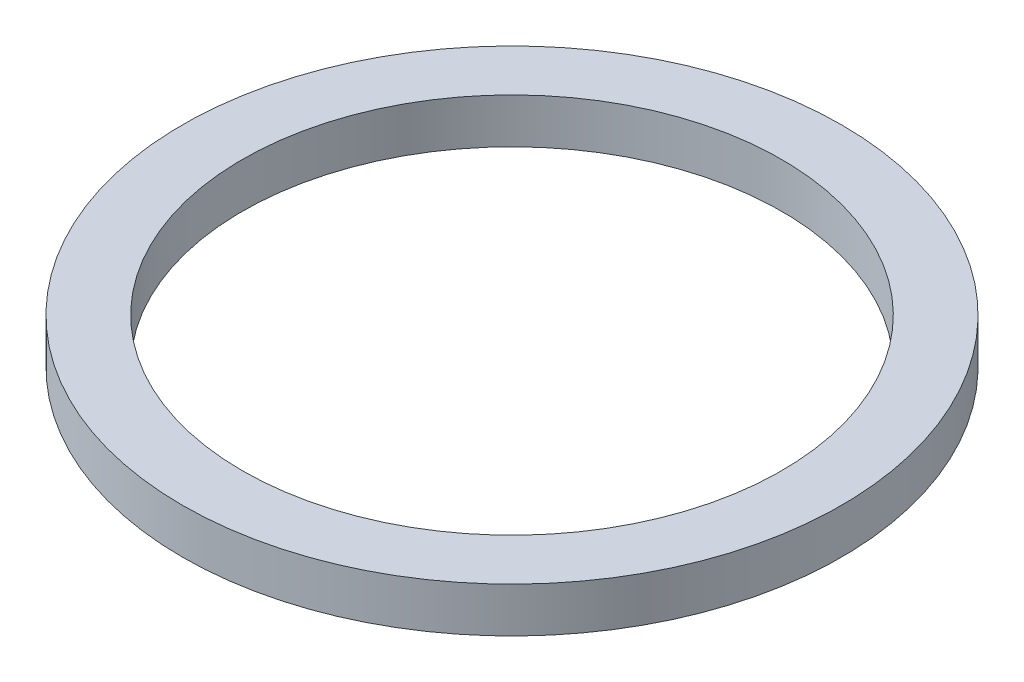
ISO-10303-21;
HEADER;
FILE_DESCRIPTION(('STEP AP214'),'2;1');
FILE_NAME('part.step','',(''),(''),'','','');
FILE_SCHEMA(('AUTOMOTIVE_DESIGN { 1 0 10303 214 1 1 1 1 }'));
ENDSEC;
DATA;
#1=APPLICATION_CONTEXT('core data for automotive mechanical design processes');
#2=APPLICATION_PROTOCOL_DEFINITION('international standard','automotive_design',2000,#1);
#3=PRODUCT_CONTEXT('',#1,'mechanical');
#4=PRODUCT('Part','Part','',(#3));
#5=PRODUCT_RELATED_PRODUCT_CATEGORY('part','',(#4));
#6=PRODUCT_DEFINITION_FORMATION('','',#4);
#7=PRODUCT_DEFINITION_CONTEXT('part definition',#1,'design');
#8=PRODUCT_DEFINITION('design','',#6,#7);
#9=PRODUCT_DEFINITION_SHAPE('','',#8);
#10=(LENGTH_UNIT() NAMED_UNIT(*) SI_UNIT(.MILLI.,.METRE.));
#11=(NAMED_UNIT(*) PLANE_ANGLE_UNIT() SI_UNIT($,.RADIAN.));
#12=(NAMED_UNIT(*) SI_UNIT($,.STERADIAN.) SOLID_ANGLE_UNIT());
#13=UNCERTAINTY_MEASURE_WITH_UNIT(LENGTH_MEASURE(1.E-05),#10,'distance_accuracy_value','');
#14=(GEOMETRIC_REPRESENTATION_CONTEXT(3) GLOBAL_UNCERTAINTY_ASSIGNED_CONTEXT((#13)) GLOBAL_UNIT_ASSIGNED_CONTEXT((#10,
#11,#12)) REPRESENTATION_CONTEXT('',''));
#15=CARTESIAN_POINT('',(0.,0.,0.));
#16=DIRECTION('',(0.,0.,1.));
#17=DIRECTION('',(1.,0.,0.));
#18=AXIS2_PLACEMENT_3D('',#15,#16,#17);
#19=CARTESIAN_POINT('',(0.,1500.,0.));
#20=DIRECTION('',(0.,1.,0.));
#21=DIRECTION('',(0.,0.,1.));
#22=AXIS2_PLACEMENT_3D('',#19,#20,#21);
#23=PLANE('',#22);
#24=CARTESIAN_POINT('',(0.,1500.,0.));
#25=DIRECTION('',(0.,1.,0.));
#26=DIRECTION('',(0.,0.,1.));
#27=AXIS2_PLACEMENT_3D('',#24,#25,#26);
#28=CIRCLE('',#27,11000.);
#29=CARTESIAN_POINT('',(0.,1500.,11000.));
#30=VERTEX_POINT('',#29);
#31=EDGE_CURVE('E10',#30,#30,#28,.T.);
#32=ORIENTED_EDGE('',*,*,#31,.T.);
#33=EDGE_LOOP('',(#32));
#34=FACE_BOUND('',#33,.T.);
#35=CARTESIAN_POINT('',(0.,1500.,0.));
#36=DIRECTION('',(0.,1.,0.));
#37=DIRECTION('',(0.,0.,1.));
#38=AXIS2_PLACEMENT_3D('',#35,#36,#37);
#39=CIRCLE('',#38,9000.);
#40=CARTESIAN_POINT('',(0.,1500.,9000.));
#41=VERTEX_POINT('',#40);
#42=EDGE_CURVE('E48',#41,#41,#39,.T.);
#43=ORIENTED_EDGE('',*,*,#42,.F.);
#44=EDGE_LOOP('',(#43));
#45=FACE_BOUND('',#44,.T.);
#46=ADVANCED_FACE('F40',(#34,#45),#23,.T.);
#47=CARTESIAN_POINT('',(0.,0.,0.));
#48=DIRECTION('',(0.,1.,0.));
#49=DIRECTION('',(0.,0.,1.));
#50=AXIS2_PLACEMENT_3D('',#47,#48,#49);
#51=PLANE('',#50);
#52=CARTESIAN_POINT('',(0.,0.,0.));
#53=DIRECTION('',(0.,1.,0.));
#54=DIRECTION('',(0.,0.,1.));
#55=AXIS2_PLACEMENT_3D('',#52,#53,#54);
#56=CIRCLE('',#55,11000.);
#57=CARTESIAN_POINT('',(0.,0.,11000.));
#58=VERTEX_POINT('',#57);
#59=EDGE_CURVE('E41',#58,#58,#56,.T.);
#60=ORIENTED_EDGE('',*,*,#59,.F.);
#61=EDGE_LOOP('',(#60));
#62=FACE_BOUND('',#61,.T.);
#63=CARTESIAN_POINT('',(0.,0.,0.));
#64=DIRECTION('',(0.,1.,0.));
#65=DIRECTION('',(0.,0.,1.));
#66=AXIS2_PLACEMENT_3D('',#63,#64,#65);
#67=CIRCLE('',#66,9000.);
#68=CARTESIAN_POINT('',(0.,0.,9000.));
#69=VERTEX_POINT('',#68);
#70=EDGE_CURVE('E49',#69,#69,#67,.T.);
#71=ORIENTED_EDGE('',*,*,#70,.T.);
#72=EDGE_LOOP('',(#71));
#73=FACE_BOUND('',#72,.T.);
#74=ADVANCED_FACE('F58',(#62,#73),#51,.F.);
#75=CARTESIAN_POINT('',(0.,1500.,0.));
#76=DIRECTION('',(0.,-1.,0.));
#77=DIRECTION('',(0.,0.,-1.));
#78=AXIS2_PLACEMENT_3D('',#75,#76,#77);
#79=CYLINDRICAL_SURFACE('',#78,11000.);
#80=ORIENTED_EDGE('',*,*,#31,.F.);
#81=EDGE_LOOP('',(#80));
#82=FACE_BOUND('',#81,.T.);
#83=ORIENTED_EDGE('',*,*,#59,.T.);
#84=EDGE_LOOP('',(#83));
#85=FACE_BOUND('',#84,.T.);
#86=ADVANCED_FACE('F39',(#82,#85),#79,.T.);
#87=CARTESIAN_POINT('',(0.,1500.,0.));
#88=DIRECTION('',(0.,-1.,0.));
#89=DIRECTION('',(0.,0.,-1.));
#90=AXIS2_PLACEMENT_3D('',#87,#88,#89);
#91=CYLINDRICAL_SURFACE('',#90,9000.);
#92=ORIENTED_EDGE('',*,*,#42,.T.);
#93=EDGE_LOOP('',(#92));
#94=FACE_BOUND('',#93,.T.);
#95=ORIENTED_EDGE('',*,*,#70,.F.);
#96=EDGE_LOOP('',(#95));
#97=FACE_BOUND('',#96,.T.);
#98=ADVANCED_FACE('F57',(#94,#97),#91,.F.);
#99=CLOSED_SHELL('',(#46,#74,#86,#98));
#100=MANIFOLD_SOLID_BREP('B2',#99);
#101=ADVANCED_BREP_SHAPE_REPRESENTATION('',(#18,#100),#14);
#102=SHAPE_DEFINITION_REPRESENTATION(#9,#101);
ENDSEC;
END-ISO-10303-21;
